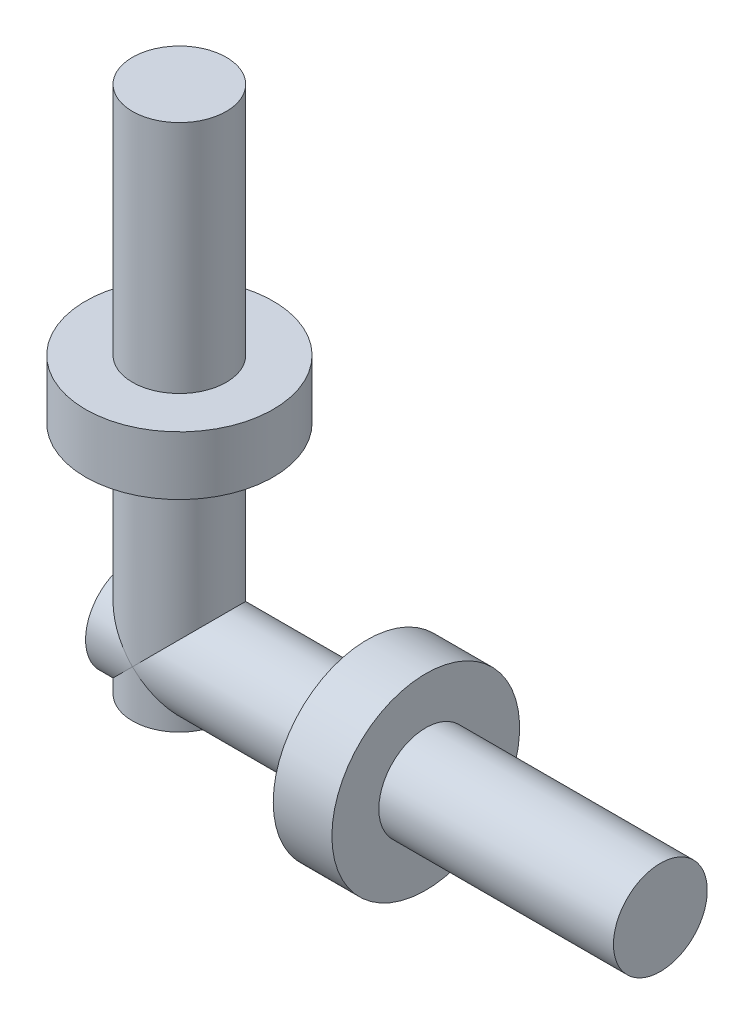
ISO-10303-21;
HEADER;
FILE_DESCRIPTION(('STEP AP214'),'2;1');
FILE_NAME('part.step','',(''),(''),'','','');
FILE_SCHEMA(('AUTOMOTIVE_DESIGN { 1 0 10303 214 1 1 1 1 }'));
ENDSEC;
DATA;
#1=APPLICATION_CONTEXT('core data for automotive mechanical design processes');
#2=APPLICATION_PROTOCOL_DEFINITION('international standard','automotive_design',2000,#1);
#3=PRODUCT_CONTEXT('',#1,'mechanical');
#4=PRODUCT('Part','Part','',(#3));
#5=PRODUCT_RELATED_PRODUCT_CATEGORY('part','',(#4));
#6=PRODUCT_DEFINITION_FORMATION('','',#4);
#7=PRODUCT_DEFINITION_CONTEXT('part definition',#1,'design');
#8=PRODUCT_DEFINITION('design','',#6,#7);
#9=PRODUCT_DEFINITION_SHAPE('','',#8);
#10=(LENGTH_UNIT() NAMED_UNIT(*) SI_UNIT(.MILLI.,.METRE.));
#11=(NAMED_UNIT(*) PLANE_ANGLE_UNIT() SI_UNIT($,.RADIAN.));
#12=(NAMED_UNIT(*) SI_UNIT($,.STERADIAN.) SOLID_ANGLE_UNIT());
#13=UNCERTAINTY_MEASURE_WITH_UNIT(LENGTH_MEASURE(1.E-05),#10,'distance_accuracy_value','');
#14=(GEOMETRIC_REPRESENTATION_CONTEXT(3) GLOBAL_UNCERTAINTY_ASSIGNED_CONTEXT((#13)) GLOBAL_UNIT_ASSIGNED_CONTEXT((#10,
#11,#12)) REPRESENTATION_CONTEXT('',''));
#15=CARTESIAN_POINT('',(0.,0.,0.));
#16=DIRECTION('',(0.,0.,1.));
#17=DIRECTION('',(1.,0.,0.));
#18=AXIS2_PLACEMENT_3D('',#15,#16,#17);
#19=CARTESIAN_POINT('',(0.,2.5,0.));
#20=DIRECTION('',(0.,-1.,0.));
#21=DIRECTION('',(0.,0.,-1.));
#22=AXIS2_PLACEMENT_3D('',#19,#20,#21);
#23=CYLINDRICAL_SURFACE('',#22,4.);
#24=CARTESIAN_POINT('',(0.,2.5,0.));
#25=DIRECTION('',(0.,1.,0.));
#26=DIRECTION('',(0.,0.,1.));
#27=AXIS2_PLACEMENT_3D('',#24,#25,#26);
#28=CIRCLE('',#27,4.);
#29=CARTESIAN_POINT('',(0.,2.5,4.));
#30=VERTEX_POINT('',#29);
#31=EDGE_CURVE('E112',#30,#30,#28,.T.);
#32=ORIENTED_EDGE('',*,*,#31,.F.);
#33=EDGE_LOOP('',(#32));
#34=FACE_BOUND('',#33,.T.);
#35=CARTESIAN_POINT('',(0.,0.,0.));
#36=DIRECTION('',(0.,1.,0.));
#37=DIRECTION('',(0.,0.,1.));
#38=AXIS2_PLACEMENT_3D('',#35,#36,#37);
#39=CIRCLE('',#38,4.);
#40=CARTESIAN_POINT('',(0.,0.,4.));
#41=VERTEX_POINT('',#40);
#42=EDGE_CURVE('E44',#41,#41,#39,.T.);
#43=ORIENTED_EDGE('',*,*,#42,.T.);
#44=EDGE_LOOP('',(#43));
#45=FACE_BOUND('',#44,.T.);
#46=ADVANCED_FACE('F41',(#34,#45),#23,.T.);
#47=CARTESIAN_POINT('',(0.,2.5,0.));
#48=DIRECTION('',(0.,1.,0.));
#49=DIRECTION('',(0.,0.,1.));
#50=AXIS2_PLACEMENT_3D('',#47,#48,#49);
#51=PLANE('',#50);
#52=CARTESIAN_POINT('',(0.,2.5,0.));
#53=DIRECTION('',(0.,1.,0.));
#54=DIRECTION('',(0.,0.,1.));
#55=AXIS2_PLACEMENT_3D('',#52,#53,#54);
#56=CIRCLE('',#55,2.);
#57=CARTESIAN_POINT('',(0.,2.5,2.));
#58=VERTEX_POINT('',#57);
#59=EDGE_CURVE('E49',#58,#58,#56,.T.);
#60=ORIENTED_EDGE('',*,*,#59,.F.);
#61=EDGE_LOOP('',(#60));
#62=FACE_BOUND('',#61,.T.);
#63=ORIENTED_EDGE('',*,*,#31,.T.);
#64=EDGE_LOOP('',(#63));
#65=FACE_BOUND('',#64,.T.);
#66=ADVANCED_FACE('F123',(#62,#65),#51,.T.);
#67=CARTESIAN_POINT('',(0.,0.,0.));
#68=DIRECTION('',(0.,1.,0.));
#69=DIRECTION('',(0.,0.,1.));
#70=AXIS2_PLACEMENT_3D('',#67,#68,#69);
#71=PLANE('',#70);
#72=CARTESIAN_POINT('',(0.,0.,0.));
#73=DIRECTION('',(0.,-1.,0.));
#74=DIRECTION('',(0.,0.,-1.));
#75=AXIS2_PLACEMENT_3D('',#72,#73,#74);
#76=CIRCLE('',#75,2.);
#77=CARTESIAN_POINT('',(0.,0.,-2.));
#78=VERTEX_POINT('',#77);
#79=EDGE_CURVE('E11',#78,#78,#76,.T.);
#80=ORIENTED_EDGE('',*,*,#79,.F.);
#81=EDGE_LOOP('',(#80));
#82=FACE_BOUND('',#81,.T.);
#83=ORIENTED_EDGE('',*,*,#42,.F.);
#84=EDGE_LOOP('',(#83));
#85=FACE_BOUND('',#84,.T.);
#86=ADVANCED_FACE('F120',(#82,#85),#71,.F.);
#87=CARTESIAN_POINT('',(0.,12.5,0.));
#88=DIRECTION('',(0.,-1.,0.));
#89=DIRECTION('',(0.,0.,-1.));
#90=AXIS2_PLACEMENT_3D('',#87,#88,#89);
#91=CYLINDRICAL_SURFACE('',#90,2.);
#92=CARTESIAN_POINT('',(0.,12.5,0.));
#93=DIRECTION('',(0.,1.,0.));
#94=DIRECTION('',(0.,0.,1.));
#95=AXIS2_PLACEMENT_3D('',#92,#93,#94);
#96=CIRCLE('',#95,2.);
#97=CARTESIAN_POINT('',(0.,12.5,2.));
#98=VERTEX_POINT('',#97);
#99=EDGE_CURVE('E106',#98,#98,#96,.T.);
#100=ORIENTED_EDGE('',*,*,#99,.F.);
#101=EDGE_LOOP('',(#100));
#102=FACE_BOUND('',#101,.T.);
#103=ORIENTED_EDGE('',*,*,#59,.T.);
#104=EDGE_LOOP('',(#103));
#105=FACE_BOUND('',#104,.T.);
#106=ADVANCED_FACE('F122',(#102,#105),#91,.T.);
#107=CARTESIAN_POINT('',(0.,12.5,0.));
#108=DIRECTION('',(0.,1.,0.));
#109=DIRECTION('',(0.,0.,1.));
#110=AXIS2_PLACEMENT_3D('',#107,#108,#109);
#111=PLANE('',#110);
#112=ORIENTED_EDGE('',*,*,#99,.T.);
#113=EDGE_LOOP('',(#112));
#114=FACE_BOUND('',#113,.T.);
#115=ADVANCED_FACE('F130',(#114),#111,.T.);
#116=CARTESIAN_POINT('',(0.,-10.,0.));
#117=DIRECTION('',(0.,1.,0.));
#118=DIRECTION('',(0.,0.,1.));
#119=AXIS2_PLACEMENT_3D('',#116,#117,#118);
#120=CYLINDRICAL_SURFACE('',#119,2.);
#121=CARTESIAN_POINT('',(0.,-7.99999999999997,0.));
#122=DIRECTION('',(-0.707106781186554,0.707106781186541,0.));
#123=DIRECTION('',(0.707106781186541,0.707106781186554,0.));
#124=AXIS2_PLACEMENT_3D('',#121,#122,#123);
#125=ELLIPSE('',#124,2.82842712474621,2.);
#126=CARTESIAN_POINT('',(0.,-7.99999999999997,2.));
#127=VERTEX_POINT('',#126);
#128=CARTESIAN_POINT('',(0.,-7.99999999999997,-2.));
#129=VERTEX_POINT('',#128);
#130=EDGE_CURVE('E65',#127,#129,#125,.T.);
#131=ORIENTED_EDGE('',*,*,#130,.T.);
#132=CARTESIAN_POINT('',(0.,-7.99999999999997,0.));
#133=DIRECTION('',(0.707106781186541,0.707106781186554,0.));
#134=DIRECTION('',(-0.707106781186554,0.707106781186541,0.));
#135=AXIS2_PLACEMENT_3D('',#132,#133,#134);
#136=ELLIPSE('',#135,2.82842712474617,2.);
#137=CARTESIAN_POINT('',(-2.00000000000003,-6.,0.));
#138=VERTEX_POINT('',#137);
#139=EDGE_CURVE('E86',#129,#138,#136,.T.);
#140=ORIENTED_EDGE('',*,*,#139,.T.);
#141=EDGE_CURVE('E76',#138,#127,#136,.T.);
#142=ORIENTED_EDGE('',*,*,#141,.T.);
#143=EDGE_LOOP('',(#131,#140,#142));
#144=FACE_BOUND('',#143,.T.);
#145=ORIENTED_EDGE('',*,*,#79,.T.);
#146=EDGE_LOOP('',(#145));
#147=FACE_BOUND('',#146,.T.);
#148=ADVANCED_FACE('F96',(#144,#147),#120,.T.);
#149=CARTESIAN_POINT('',(-2.00000000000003,-8.,0.));
#150=DIRECTION('',(1.,0.,0.));
#151=DIRECTION('',(0.,1.,0.));
#152=AXIS2_PLACEMENT_3D('',#149,#150,#151);
#153=CYLINDRICAL_SURFACE('',#152,2.);
#154=ORIENTED_EDGE('',*,*,#139,.F.);
#155=CARTESIAN_POINT('',(0.,-7.99999999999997,0.));
#156=DIRECTION('',(-0.707106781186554,0.707106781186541,0.));
#157=DIRECTION('',(0.707106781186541,0.707106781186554,0.));
#158=AXIS2_PLACEMENT_3D('',#155,#156,#157);
#159=ELLIPSE('',#158,2.82842712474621,2.);
#160=CARTESIAN_POINT('',(-2.,-10.,0.));
#161=VERTEX_POINT('',#160);
#162=EDGE_CURVE('E57',#161,#129,#159,.F.);
#163=ORIENTED_EDGE('',*,*,#162,.F.);
#164=CARTESIAN_POINT('',(-2.00000000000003,-8.,0.));
#165=DIRECTION('',(1.,0.,0.));
#166=DIRECTION('',(0.,0.,-1.));
#167=AXIS2_PLACEMENT_3D('',#164,#165,#166);
#168=CIRCLE('',#167,2.);
#169=EDGE_CURVE('E90',#161,#138,#168,.T.);
#170=ORIENTED_EDGE('',*,*,#169,.T.);
#171=EDGE_LOOP('',(#154,#163,#170));
#172=FACE_BOUND('',#171,.T.);
#173=ADVANCED_FACE('F91',(#172),#153,.T.);
#174=CARTESIAN_POINT('',(-2.00000000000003,-8.,0.));
#175=DIRECTION('',(-1.,0.,0.));
#176=DIRECTION('',(0.,0.,-1.));
#177=AXIS2_PLACEMENT_3D('',#174,#175,#176);
#178=PLANE('',#177);
#179=EDGE_CURVE('E80',#138,#161,#168,.T.);
#180=ORIENTED_EDGE('',*,*,#179,.F.);
#181=ORIENTED_EDGE('',*,*,#169,.F.);
#182=EDGE_LOOP('',(#180,#181));
#183=FACE_BOUND('',#182,.T.);
#184=ADVANCED_FACE('F95',(#183),#178,.T.);
#185=EDGE_CURVE('E82',#127,#161,#159,.F.);
#186=ORIENTED_EDGE('',*,*,#185,.F.);
#187=ORIENTED_EDGE('',*,*,#141,.F.);
#188=ORIENTED_EDGE('',*,*,#179,.T.);
#189=EDGE_LOOP('',(#186,#187,#188));
#190=FACE_BOUND('',#189,.T.);
#191=ADVANCED_FACE('F78',(#190),#153,.T.);
#192=CARTESIAN_POINT('',(7.99999999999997,-7.99999999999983,0.));
#193=DIRECTION('',(1.,0.,0.));
#194=DIRECTION('',(0.,0.,-1.));
#195=AXIS2_PLACEMENT_3D('',#192,#193,#194);
#196=CIRCLE('',#195,2.);
#197=CARTESIAN_POINT('',(7.99999999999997,-7.99999999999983,-2.));
#198=VERTEX_POINT('',#197);
#199=EDGE_CURVE('E93',#198,#198,#196,.T.);
#200=ORIENTED_EDGE('',*,*,#199,.F.);
#201=EDGE_LOOP('',(#200));
#202=FACE_BOUND('',#201,.T.);
#203=CARTESIAN_POINT('',(0.,-7.99999999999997,0.));
#204=DIRECTION('',(0.707106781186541,0.707106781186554,0.));
#205=DIRECTION('',(-0.707106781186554,0.707106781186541,0.));
#206=AXIS2_PLACEMENT_3D('',#203,#204,#205);
#207=ELLIPSE('',#206,2.82842712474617,2.);
#208=CARTESIAN_POINT('',(2.,-9.99999999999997,0.));
#209=VERTEX_POINT('',#208);
#210=EDGE_CURVE('E99',#129,#209,#207,.F.);
#211=ORIENTED_EDGE('',*,*,#210,.F.);
#212=ORIENTED_EDGE('',*,*,#130,.F.);
#213=EDGE_CURVE('E98',#209,#127,#207,.F.);
#214=ORIENTED_EDGE('',*,*,#213,.F.);
#215=EDGE_LOOP('',(#211,#212,#214));
#216=FACE_BOUND('',#215,.T.);
#217=ADVANCED_FACE('F179',(#202,#216),#153,.T.);
#218=CARTESIAN_POINT('',(0.,-10.,0.));
#219=DIRECTION('',(0.,-1.,0.));
#220=DIRECTION('',(0.,0.,-1.));
#221=AXIS2_PLACEMENT_3D('',#218,#219,#220);
#222=PLANE('',#221);
#223=CARTESIAN_POINT('',(0.,-10.,0.));
#224=DIRECTION('',(0.,-1.,0.));
#225=DIRECTION('',(0.,0.,-1.));
#226=AXIS2_PLACEMENT_3D('',#223,#224,#225);
#227=CIRCLE('',#226,2.);
#228=EDGE_CURVE('E107',#161,#209,#227,.T.);
#229=ORIENTED_EDGE('',*,*,#228,.T.);
#230=EDGE_CURVE('E104',#209,#161,#227,.T.);
#231=ORIENTED_EDGE('',*,*,#230,.T.);
#232=EDGE_LOOP('',(#229,#231));
#233=FACE_BOUND('',#232,.T.);
#234=ADVANCED_FACE('F174',(#233),#222,.T.);
#235=ORIENTED_EDGE('',*,*,#162,.T.);
#236=ORIENTED_EDGE('',*,*,#210,.T.);
#237=ORIENTED_EDGE('',*,*,#228,.F.);
#238=EDGE_LOOP('',(#235,#236,#237));
#239=FACE_BOUND('',#238,.T.);
#240=ADVANCED_FACE('F168',(#239),#120,.T.);
#241=ORIENTED_EDGE('',*,*,#213,.T.);
#242=ORIENTED_EDGE('',*,*,#185,.T.);
#243=ORIENTED_EDGE('',*,*,#230,.F.);
#244=EDGE_LOOP('',(#241,#242,#243));
#245=FACE_BOUND('',#244,.T.);
#246=ADVANCED_FACE('F169',(#245),#120,.T.);
#247=CARTESIAN_POINT('',(10.5,-7.99999999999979,0.));
#248=DIRECTION('',(-1.,0.,0.));
#249=DIRECTION('',(0.,-1.,0.));
#250=AXIS2_PLACEMENT_3D('',#247,#248,#249);
#251=CYLINDRICAL_SURFACE('',#250,4.);
#252=CARTESIAN_POINT('',(10.5,-7.99999999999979,0.));
#253=DIRECTION('',(-1.,0.,0.));
#254=DIRECTION('',(0.,0.,1.));
#255=AXIS2_PLACEMENT_3D('',#252,#253,#254);
#256=CIRCLE('',#255,4.);
#257=CARTESIAN_POINT('',(10.5,-7.99999999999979,4.));
#258=VERTEX_POINT('',#257);
#259=EDGE_CURVE('E284',#258,#258,#256,.T.);
#260=ORIENTED_EDGE('',*,*,#259,.T.);
#261=EDGE_LOOP('',(#260));
#262=FACE_BOUND('',#261,.T.);
#263=CARTESIAN_POINT('',(7.99999999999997,-7.99999999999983,0.));
#264=DIRECTION('',(-1.,0.,0.));
#265=DIRECTION('',(0.,0.,1.));
#266=AXIS2_PLACEMENT_3D('',#263,#264,#265);
#267=CIRCLE('',#266,4.);
#268=CARTESIAN_POINT('',(7.99999999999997,-7.99999999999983,4.));
#269=VERTEX_POINT('',#268);
#270=EDGE_CURVE('E280',#269,#269,#267,.T.);
#271=ORIENTED_EDGE('',*,*,#270,.F.);
#272=EDGE_LOOP('',(#271));
#273=FACE_BOUND('',#272,.T.);
#274=ADVANCED_FACE('F191',(#262,#273),#251,.T.);
#275=CARTESIAN_POINT('',(10.5,-7.99999999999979,0.));
#276=DIRECTION('',(1.,0.,0.));
#277=DIRECTION('',(0.,0.,1.));
#278=AXIS2_PLACEMENT_3D('',#275,#276,#277);
#279=PLANE('',#278);
#280=CARTESIAN_POINT('',(10.5,-7.99999999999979,0.));
#281=DIRECTION('',(-1.,0.,0.));
#282=DIRECTION('',(0.,0.,1.));
#283=AXIS2_PLACEMENT_3D('',#280,#281,#282);
#284=CIRCLE('',#283,2.);
#285=CARTESIAN_POINT('',(10.5,-7.99999999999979,2.));
#286=VERTEX_POINT('',#285);
#287=EDGE_CURVE('E281',#286,#286,#284,.T.);
#288=ORIENTED_EDGE('',*,*,#287,.T.);
#289=EDGE_LOOP('',(#288));
#290=FACE_BOUND('',#289,.T.);
#291=ORIENTED_EDGE('',*,*,#259,.F.);
#292=EDGE_LOOP('',(#291));
#293=FACE_BOUND('',#292,.T.);
#294=ADVANCED_FACE('F234',(#290,#293),#279,.T.);
#295=CARTESIAN_POINT('',(7.99999999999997,-7.99999999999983,0.));
#296=DIRECTION('',(1.,0.,0.));
#297=DIRECTION('',(0.,0.,1.));
#298=AXIS2_PLACEMENT_3D('',#295,#296,#297);
#299=PLANE('',#298);
#300=ORIENTED_EDGE('',*,*,#199,.T.);
#301=EDGE_LOOP('',(#300));
#302=FACE_BOUND('',#301,.T.);
#303=ORIENTED_EDGE('',*,*,#270,.T.);
#304=EDGE_LOOP('',(#303));
#305=FACE_BOUND('',#304,.T.);
#306=ADVANCED_FACE('F245',(#302,#305),#299,.F.);
#307=CARTESIAN_POINT('',(20.5,-7.99999999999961,0.));
#308=DIRECTION('',(-1.,0.,0.));
#309=DIRECTION('',(0.,-1.,0.));
#310=AXIS2_PLACEMENT_3D('',#307,#308,#309);
#311=CYLINDRICAL_SURFACE('',#310,2.);
#312=CARTESIAN_POINT('',(20.5,-7.99999999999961,0.));
#313=DIRECTION('',(-1.,0.,0.));
#314=DIRECTION('',(0.,0.,1.));
#315=AXIS2_PLACEMENT_3D('',#312,#313,#314);
#316=CIRCLE('',#315,2.);
#317=CARTESIAN_POINT('',(20.5,-7.99999999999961,2.));
#318=VERTEX_POINT('',#317);
#319=EDGE_CURVE('E279',#318,#318,#316,.T.);
#320=ORIENTED_EDGE('',*,*,#319,.T.);
#321=EDGE_LOOP('',(#320));
#322=FACE_BOUND('',#321,.T.);
#323=ORIENTED_EDGE('',*,*,#287,.F.);
#324=EDGE_LOOP('',(#323));
#325=FACE_BOUND('',#324,.T.);
#326=ADVANCED_FACE('F255',(#322,#325),#311,.T.);
#327=CARTESIAN_POINT('',(20.5,-7.99999999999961,0.));
#328=DIRECTION('',(1.,0.,0.));
#329=DIRECTION('',(0.,0.,1.));
#330=AXIS2_PLACEMENT_3D('',#327,#328,#329);
#331=PLANE('',#330);
#332=ORIENTED_EDGE('',*,*,#319,.F.);
#333=EDGE_LOOP('',(#332));
#334=FACE_BOUND('',#333,.T.);
#335=ADVANCED_FACE('F264',(#334),#331,.T.);
#336=CLOSED_SHELL('',(#46,#66,#86,#106,#115,#148,#173,#184,#191,#217,#234,#240,#246,#274,#294,
#306,#326,#335));
#337=MANIFOLD_SOLID_BREP('B2',#336);
#338=ADVANCED_BREP_SHAPE_REPRESENTATION('',(#18,#337),#14);
#339=SHAPE_DEFINITION_REPRESENTATION(#9,#338);
ENDSEC;
END-ISO-10303-21;
